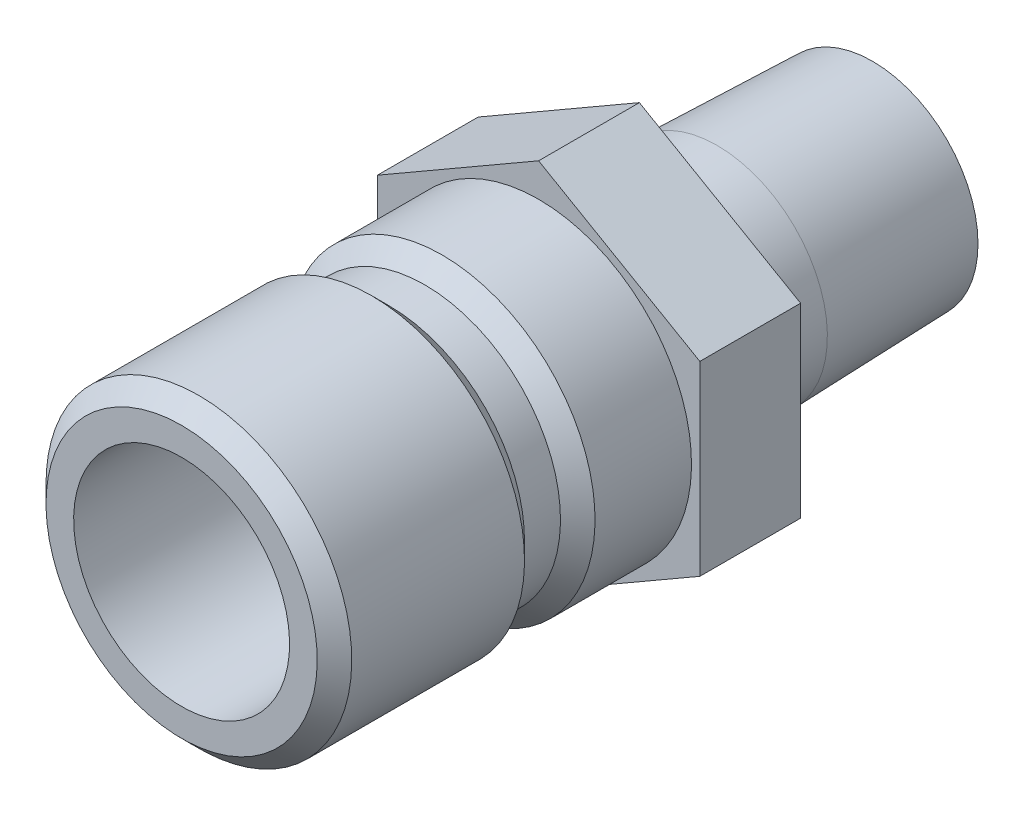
from build123d import *

# Parameters (mm, degrees)
SKETCH2_R           = 3.4163
BOSS_EXTRUDE1_DEPTH = 4.445


with BuildPart() as part:
    # Sketch1 → Revolve1 (revolve)
    with BuildSketch(Plane(origin=(0, 0, 0), x_dir=(0, 0, -1), z_dir=(1, 0, 0))):
        Polygon((-15.748, 4.7625), (-15.748, 5.9817), (-14.986, 6.7437), (-7.366, 6.7437), (-6.604, 5.9817), (-5.0165, 5.9817), (-4.2545, 6.7437), (0, 6.7437), (0, 4.8641), (7.874, 4.8641), (14.732, 4.649788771), (14.732, 3.4163), (-2.840212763, 3.4163), (-3.556, 4.7625), align=None)
    revolve(axis=Axis((0, 0, 0), (0, 0, 1)))

    # Sketch2 → Boss-Extrude1 (add)
    with BuildSketch(Plane.XY):
        Polygon((-7.112, 4.106115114), (-7.112, -4.106115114), (0, -8.212230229), (7.112, -4.106115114), (7.112, 4.106115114), (0, 8.212230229), align=None)
        with Locations(Location((0, 0, 0), (0, 0, 90))):
            Circle(SKETCH2_R, mode=Mode.SUBTRACT)
    extrude(amount=-BOSS_EXTRUDE1_DEPTH)


solid = part.part
